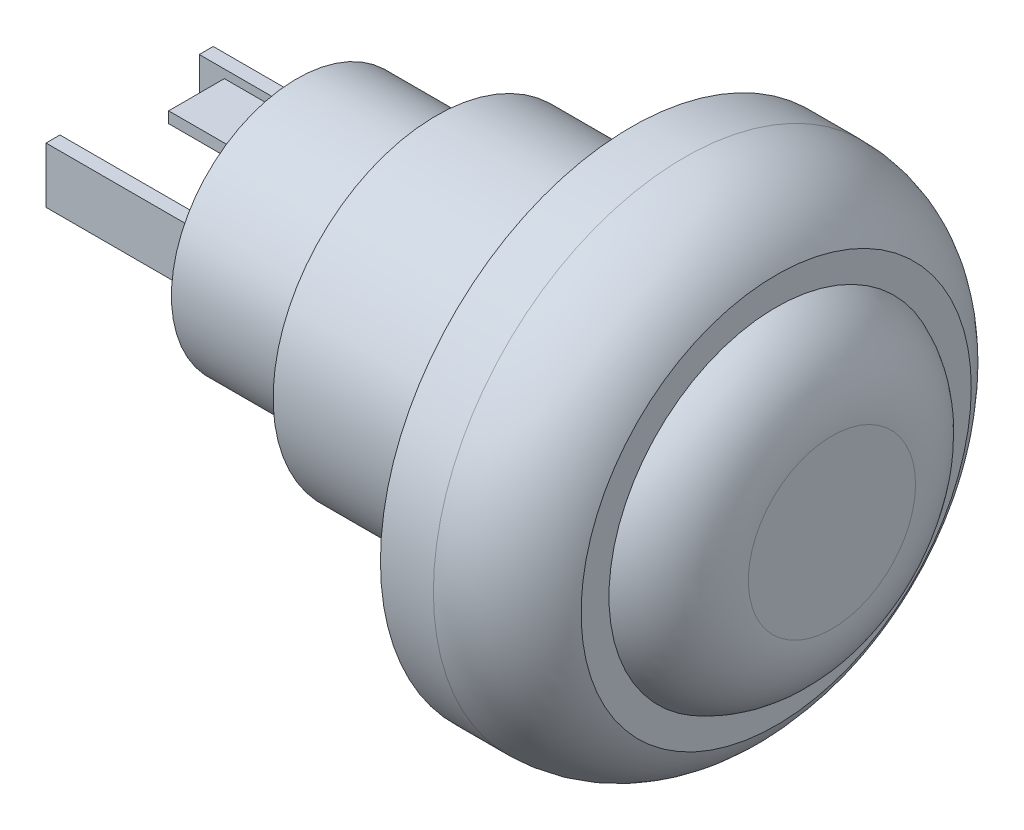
from build123d import *

# Parameters (mm, degrees)
SKICA2_W                  = 0.5
SKICA2_H                  = 2
VYSUNOUT1_DEPTH           = 6
SKICA3_W                  = 2
SKICA3_H                  = 0.4
P_IDAT_VYSUNUT_M1_DEPTH   = 3.6
ODEBRAT_VYSUNUT_M14_DEPTH = 1


with BuildPart() as part:
    # Skica1 → Rotovat1 (revolve)
    with BuildSketch(Plane.XY, mode=Mode.PRIVATE) as rotovat1_sk:
        with BuildLine():
            Line((0, 0), (0, 4.5))
            Line((0, 4.5), (5, 4.5))
            Line((5, 4.5), (5, 5.85))
            Line((5, 5.85), (11, 5.85))
            Line((11, 5.85), (11, 6.75))
            Line((11, 6.75), (12, 6.75))
            Line((12, 6.75), (12, 9))
            Line((12, 9), (13.9, 9))
            ThreePointArc((13.9, 9), (15.829378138, 8.460973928), (17.2, 7))
            Line((17.2, 7), (17.2, 6))
            ThreePointArc((17.2, 6), (18.671023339, 4.814015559), (19.2, 3))
            Line((19.2, 3), (19.2, 0))
            Line((19.2, 0), (0, 0))
        make_face()
    revolve(rotovat1_sk.sketch.rotate(Axis((0, 0, 0), (-1, 0, 0)), 90), axis=Axis((0, 0, 0), (-1, 0, 0)))

    # Skica2 → Vysunout1 (add)
    with BuildSketch(Plane.ZY):
        with Locations((-2.75, 0)):
            Rectangle(SKICA2_W, SKICA2_H)
        with Locations((2.75, 0)):
            Rectangle(SKICA2_W, SKICA2_H)
    extrude(amount=VYSUNOUT1_DEPTH)

    # Skica3 → P_idat vysunut_m1 (add)
    with BuildSketch(Plane.ZY):
        with Locations((0, 2)):
            Rectangle(SKICA3_W, SKICA3_H)
        with Locations((0, -2)):
            Rectangle(SKICA3_W, SKICA3_H)
    extrude(amount=P_IDAT_VYSUNUT_M1_DEPTH)

    # Skica4 → Odebrat vysunut_m14 (cut)
    with BuildSketch(Plane.ZY.offset(-11)):
        Polygon((-51.784513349, 7.569952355), (-3.111129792, 5.990273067), (3.49299846, 5.775938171), (52.166382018, 4.196258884), (55.325740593, 101.543025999), (-48.625154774, 104.91671947), align=None)
    extrude(amount=-ODEBRAT_VYSUNUT_M14_DEPTH, mode=Mode.SUBTRACT)


solid = part.part
